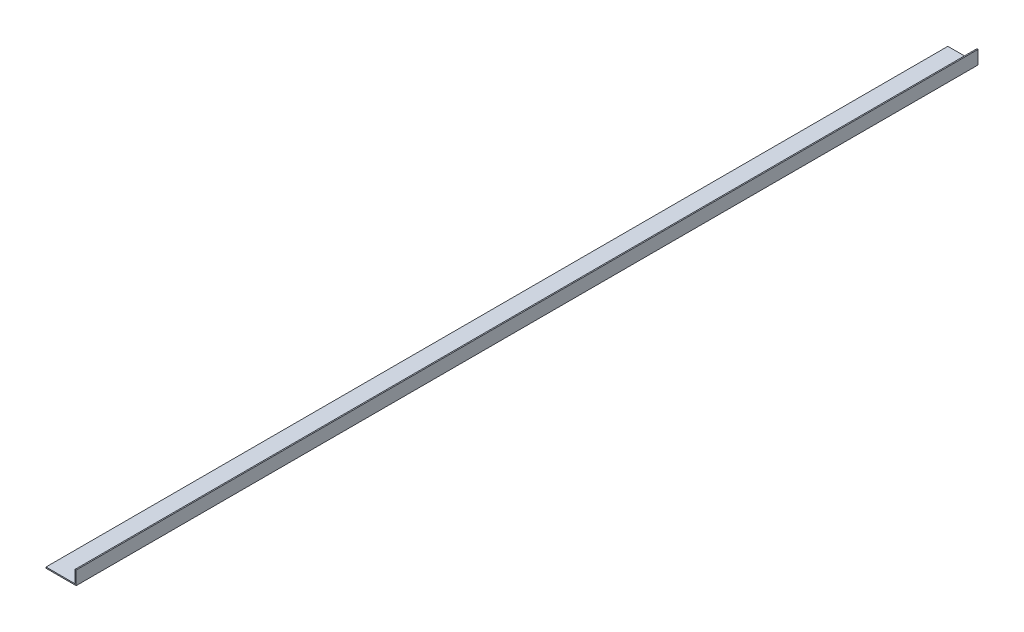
from build123d import *

# Parameters (mm, degrees)
BASE_EXTRUSION_DEPTH = 1196.564065


with BuildPart() as part:
    # Esquisse1 → Base-Extrusion (new body)
    with BuildSketch(Plane.XY):
        Polygon((55, 3937.352921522), (55, 3955.352921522), (53.5, 3955.352921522), (53.5, 3938.852921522), (15, 3938.852921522), (15, 3937.352921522), align=None)
    extrude(amount=-BASE_EXTRUSION_DEPTH)


solid = part.part
